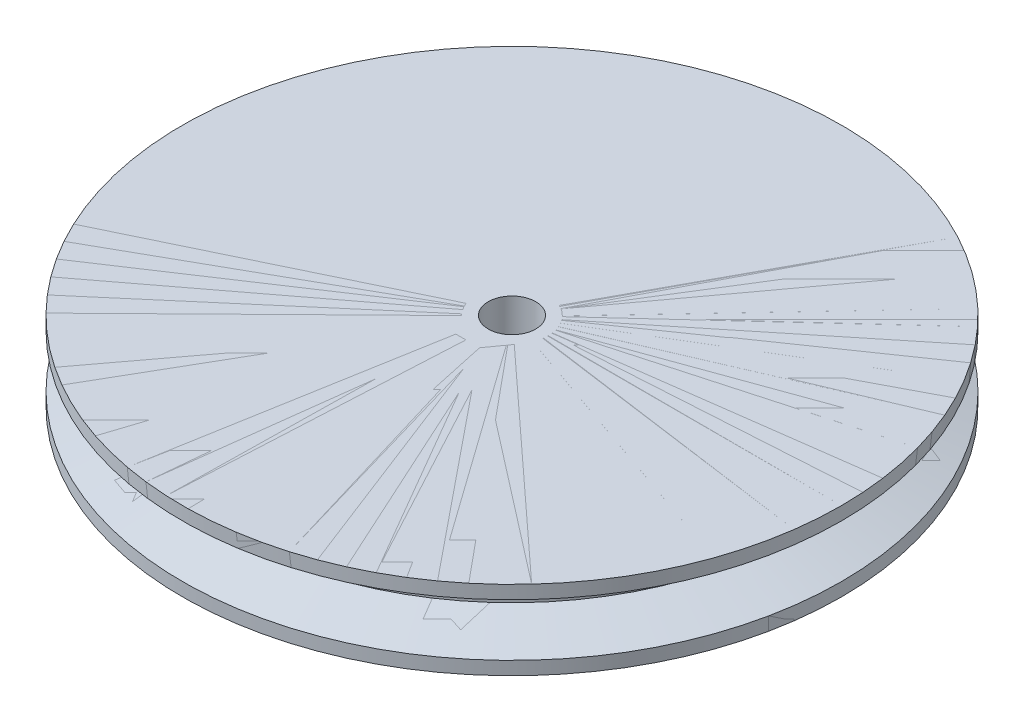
ISO-10303-21;
HEADER;
FILE_DESCRIPTION(('STEP AP214'),'2;1');
FILE_NAME('part.step','',(''),(''),'','','');
FILE_SCHEMA(('AUTOMOTIVE_DESIGN { 1 0 10303 214 1 1 1 1 }'));
ENDSEC;
DATA;
#1=APPLICATION_CONTEXT('core data for automotive mechanical design processes');
#2=APPLICATION_PROTOCOL_DEFINITION('international standard','automotive_design',2000,#1);
#3=PRODUCT_CONTEXT('',#1,'mechanical');
#4=PRODUCT('Part','Part','',(#3));
#5=PRODUCT_RELATED_PRODUCT_CATEGORY('part','',(#4));
#6=PRODUCT_DEFINITION_FORMATION('','',#4);
#7=PRODUCT_DEFINITION_CONTEXT('part definition',#1,'design');
#8=PRODUCT_DEFINITION('design','',#6,#7);
#9=PRODUCT_DEFINITION_SHAPE('','',#8);
#10=(LENGTH_UNIT() NAMED_UNIT(*) SI_UNIT(.MILLI.,.METRE.));
#11=(NAMED_UNIT(*) PLANE_ANGLE_UNIT() SI_UNIT($,.RADIAN.));
#12=(NAMED_UNIT(*) SI_UNIT($,.STERADIAN.) SOLID_ANGLE_UNIT());
#13=UNCERTAINTY_MEASURE_WITH_UNIT(LENGTH_MEASURE(1.E-05),#10,'distance_accuracy_value','');
#14=(GEOMETRIC_REPRESENTATION_CONTEXT(3) GLOBAL_UNCERTAINTY_ASSIGNED_CONTEXT((#13)) GLOBAL_UNIT_ASSIGNED_CONTEXT((#10,
#11,#12)) REPRESENTATION_CONTEXT('',''));
#15=CARTESIAN_POINT('',(0.,0.,0.));
#16=DIRECTION('',(0.,0.,1.));
#17=DIRECTION('',(1.,0.,0.));
#18=AXIS2_PLACEMENT_3D('',#15,#16,#17);
#19=CARTESIAN_POINT('',(-3.,0.,11.2));
#20=DIRECTION('',(0.,0.,1.));
#21=DIRECTION('',(0.,-1.,0.));
#22=AXIS2_PLACEMENT_3D('',#19,#20,#21);
#23=PLANE('',#22);
#24=DIRECTION('',(0.,-1.,0.));
#25=VECTOR('',#24,1.);
#26=CARTESIAN_POINT('',(3.,0.,11.2));
#27=LINE('',#26,#25);
#28=CARTESIAN_POINT('',(3.,0.,11.2));
#29=VERTEX_POINT('',#28);
#30=CARTESIAN_POINT('',(2.99999999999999,-33.,11.2));
#31=VERTEX_POINT('',#30);
#32=EDGE_CURVE('P0_E85',#29,#31,#27,.T.);
#33=ORIENTED_EDGE('',*,*,#32,.T.);
#34=CARTESIAN_POINT('',(0.,-33.,11.2));
#35=DIRECTION('',(0.,0.,-1.));
#36=DIRECTION('',(0.,1.,0.));
#37=AXIS2_PLACEMENT_3D('',#34,#35,#36);
#38=CIRCLE('',#37,3.);
#39=CARTESIAN_POINT('',(-3.,-33.,11.2));
#40=VERTEX_POINT('',#39);
#41=EDGE_CURVE('P0_E44',#40,#31,#38,.T.);
#42=ORIENTED_EDGE('',*,*,#41,.F.);
#43=DIRECTION('',(0.,-1.,0.));
#44=VECTOR('',#43,1.);
#45=CARTESIAN_POINT('',(-3.,0.,11.2));
#46=LINE('',#45,#44);
#47=CARTESIAN_POINT('',(-3.,0.,11.2));
#48=VERTEX_POINT('',#47);
#49=EDGE_CURVE('P0_E83',#48,#40,#46,.T.);
#50=ORIENTED_EDGE('',*,*,#49,.F.);
#51=DIRECTION('',(-1.,0.,0.));
#52=VECTOR('',#51,1.);
#53=CARTESIAN_POINT('',(-3.,0.,11.2));
#54=LINE('',#53,#52);
#55=EDGE_CURVE('P0_E52',#29,#48,#54,.T.);
#56=ORIENTED_EDGE('',*,*,#55,.F.);
#57=EDGE_LOOP('',(#33,#42,#50,#56));
#58=FACE_BOUND('',#57,.T.);
#59=ADVANCED_FACE('P0_F28',(#58),#23,.F.);
#60=CARTESIAN_POINT('',(0.,0.,0.));
#61=DIRECTION('',(0.,-1.,0.));
#62=DIRECTION('',(1.,0.,0.));
#63=AXIS2_PLACEMENT_3D('',#60,#61,#62);
#64=CYLINDRICAL_SURFACE('',#63,83.3);
#65=CARTESIAN_POINT('',(0.,-3.3637188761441,0.));
#66=DIRECTION('',(0.,1.,0.));
#67=DIRECTION('',(0.,0.,-1.));
#68=AXIS2_PLACEMENT_3D('',#65,#66,#67);
#69=CIRCLE('',#68,83.3);
#70=CARTESIAN_POINT('',(0.,-3.3637188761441,-83.3));
#71=VERTEX_POINT('',#70);
#72=EDGE_CURVE('P0_E117',#71,#71,#69,.T.);
#73=ORIENTED_EDGE('',*,*,#72,.T.);
#74=EDGE_LOOP('',(#73));
#75=FACE_BOUND('',#74,.T.);
#76=CARTESIAN_POINT('',(0.,0.,0.));
#77=DIRECTION('',(0.,-1.,0.));
#78=DIRECTION('',(1.,0.,0.));
#79=AXIS2_PLACEMENT_3D('',#76,#77,#78);
#80=CIRCLE('',#79,83.3);
#81=CARTESIAN_POINT('',(83.3,0.,0.));
#82=VERTEX_POINT('',#81);
#83=EDGE_CURVE('P0_E32',#82,#82,#80,.F.);
#84=ORIENTED_EDGE('',*,*,#83,.F.);
#85=EDGE_LOOP('',(#84));
#86=FACE_BOUND('',#85,.T.);
#87=ADVANCED_FACE('P0_F146',(#75,#86),#64,.T.);
#88=CARTESIAN_POINT('',(0.,0.,-41.65));
#89=DIRECTION('',(0.,1.,0.));
#90=DIRECTION('',(0.,0.,1.));
#91=AXIS2_PLACEMENT_3D('',#88,#89,#90);
#92=PLANE('',#91);
#93=CARTESIAN_POINT('',(0.,0.,0.));
#94=DIRECTION('',(0.,-1.,0.));
#95=DIRECTION('',(1.,0.,0.));
#96=AXIS2_PLACEMENT_3D('',#93,#94,#95);
#97=CIRCLE('',#96,9.);
#98=CARTESIAN_POINT('',(-3.,0.,8.48528137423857));
#99=VERTEX_POINT('',#98);
#100=CARTESIAN_POINT('',(3.,0.,8.48528137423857));
#101=VERTEX_POINT('',#100);
#102=EDGE_CURVE('P0_E291',#99,#101,#97,.T.);
#103=ORIENTED_EDGE('',*,*,#102,.T.);
#104=DIRECTION('',(0.,0.,1.));
#105=VECTOR('',#104,1.);
#106=CARTESIAN_POINT('',(3.,0.,11.2));
#107=LINE('',#106,#105);
#108=EDGE_CURVE('P0_E293',#101,#29,#107,.T.);
#109=ORIENTED_EDGE('',*,*,#108,.T.);
#110=ORIENTED_EDGE('',*,*,#55,.T.);
#111=DIRECTION('',(0.,0.,-1.));
#112=VECTOR('',#111,1.);
#113=CARTESIAN_POINT('',(-3.,0.,8.48528137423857));
#114=LINE('',#113,#112);
#115=EDGE_CURVE('P0_E97',#48,#99,#114,.T.);
#116=ORIENTED_EDGE('',*,*,#115,.T.);
#117=EDGE_LOOP('',(#103,#109,#110,#116));
#118=FACE_BOUND('',#117,.T.);
#119=ORIENTED_EDGE('',*,*,#83,.T.);
#120=EDGE_LOOP('',(#119));
#121=FACE_BOUND('',#120,.T.);
#122=ADVANCED_FACE('P0_F152',(#118,#121),#92,.T.);
#123=CARTESIAN_POINT('',(0.,-7.49565023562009,0.));
#124=DIRECTION('',(0.,1.,0.));
#125=DIRECTION('',(-1.,0.,0.));
#126=AXIS2_PLACEMENT_3D('',#123,#124,#125);
#127=CONICAL_SURFACE('',#126,71.3,1.23918376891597);
#128=CARTESIAN_POINT('',(0.,-7.49565023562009,0.));
#129=DIRECTION('',(0.,1.,0.));
#130=DIRECTION('',(0.,0.,-1.));
#131=AXIS2_PLACEMENT_3D('',#128,#129,#130);
#132=CIRCLE('',#131,71.3);
#133=CARTESIAN_POINT('',(0.,-7.49565023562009,-71.3));
#134=VERTEX_POINT('',#133);
#135=EDGE_CURVE('P0_E114',#134,#134,#132,.T.);
#136=ORIENTED_EDGE('',*,*,#135,.T.);
#137=EDGE_LOOP('',(#136));
#138=FACE_BOUND('',#137,.T.);
#139=ORIENTED_EDGE('',*,*,#72,.F.);
#140=EDGE_LOOP('',(#139));
#141=FACE_BOUND('',#140,.T.);
#142=ADVANCED_FACE('P0_F141',(#138,#141),#127,.T.);
#143=CARTESIAN_POINT('',(0.,-7.49565023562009,0.));
#144=DIRECTION('',(0.,-1.,0.));
#145=DIRECTION('',(1.,0.,0.));
#146=AXIS2_PLACEMENT_3D('',#143,#144,#145);
#147=CYLINDRICAL_SURFACE('',#146,71.3);
#148=CARTESIAN_POINT('',(0.,-12.5043497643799,0.));
#149=DIRECTION('',(0.,-1.,0.));
#150=DIRECTION('',(0.,0.,-1.));
#151=AXIS2_PLACEMENT_3D('',#148,#149,#150);
#152=CIRCLE('',#151,71.3);
#153=CARTESIAN_POINT('',(0.,-12.5043497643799,-71.3));
#154=VERTEX_POINT('',#153);
#155=EDGE_CURVE('P0_E111',#154,#154,#152,.F.);
#156=ORIENTED_EDGE('',*,*,#155,.T.);
#157=EDGE_LOOP('',(#156));
#158=FACE_BOUND('',#157,.T.);
#159=ORIENTED_EDGE('',*,*,#135,.F.);
#160=EDGE_LOOP('',(#159));
#161=FACE_BOUND('',#160,.T.);
#162=ADVANCED_FACE('P0_F130',(#158,#161),#147,.T.);
#163=CARTESIAN_POINT('',(0.,-40.,-15.));
#164=DIRECTION('',(0.,-1.,0.));
#165=DIRECTION('',(1.,0.,0.));
#166=AXIS2_PLACEMENT_3D('',#163,#164,#165);
#167=PLANE('',#166);
#168=CARTESIAN_POINT('',(0.,-40.,0.));
#169=DIRECTION('',(0.,-1.,0.));
#170=DIRECTION('',(1.,0.,0.));
#171=AXIS2_PLACEMENT_3D('',#168,#169,#170);
#172=CIRCLE('',#171,9.);
#173=CARTESIAN_POINT('',(-3.00000000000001,-40.,8.48528137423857));
#174=VERTEX_POINT('',#173);
#175=CARTESIAN_POINT('',(2.99999999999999,-40.,8.48528137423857));
#176=VERTEX_POINT('',#175);
#177=EDGE_CURVE('P0_E187',#174,#176,#172,.T.);
#178=ORIENTED_EDGE('',*,*,#177,.F.);
#179=DIRECTION('',(0.,0.,-1.));
#180=VECTOR('',#179,1.);
#181=CARTESIAN_POINT('',(-3.00000000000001,-40.,8.48528137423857));
#182=LINE('',#181,#180);
#183=CARTESIAN_POINT('',(-3.00000000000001,-40.,11.2));
#184=VERTEX_POINT('',#183);
#185=EDGE_CURVE('P0_E294',#184,#174,#182,.T.);
#186=ORIENTED_EDGE('',*,*,#185,.F.);
#187=DIRECTION('',(-1.,0.,0.));
#188=VECTOR('',#187,1.);
#189=CARTESIAN_POINT('',(-3.00000000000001,-40.,11.2));
#190=LINE('',#189,#188);
#191=CARTESIAN_POINT('',(2.99999999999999,-40.,11.2));
#192=VERTEX_POINT('',#191);
#193=EDGE_CURVE('P0_E90',#192,#184,#190,.T.);
#194=ORIENTED_EDGE('',*,*,#193,.F.);
#195=DIRECTION('',(0.,0.,1.));
#196=VECTOR('',#195,1.);
#197=CARTESIAN_POINT('',(2.99999999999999,-40.,11.2));
#198=LINE('',#197,#196);
#199=EDGE_CURVE('P0_E300',#176,#192,#198,.T.);
#200=ORIENTED_EDGE('',*,*,#199,.F.);
#201=EDGE_LOOP('',(#178,#186,#194,#200));
#202=FACE_BOUND('',#201,.T.);
#203=CARTESIAN_POINT('',(0.,-40.,0.));
#204=DIRECTION('',(0.,-1.,0.));
#205=DIRECTION('',(1.,0.,0.));
#206=AXIS2_PLACEMENT_3D('',#203,#204,#205);
#207=CIRCLE('',#206,30.);
#208=CARTESIAN_POINT('',(30.,-40.,0.));
#209=VERTEX_POINT('',#208);
#210=EDGE_CURVE('P0_E110',#209,#209,#207,.F.);
#211=ORIENTED_EDGE('',*,*,#210,.F.);
#212=EDGE_LOOP('',(#211));
#213=FACE_BOUND('',#212,.T.);
#214=ADVANCED_FACE('P0_F127',(#202,#213),#167,.T.);
#215=CARTESIAN_POINT('',(0.,-12.5043497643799,0.));
#216=DIRECTION('',(0.,-1.,0.));
#217=DIRECTION('',(1.,0.,0.));
#218=AXIS2_PLACEMENT_3D('',#215,#216,#217);
#219=CONICAL_SURFACE('',#218,71.3,1.23918376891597);
#220=CARTESIAN_POINT('',(0.,-16.6362811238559,0.));
#221=DIRECTION('',(0.,-1.,0.));
#222=DIRECTION('',(0.,0.,-1.));
#223=AXIS2_PLACEMENT_3D('',#220,#221,#222);
#224=CIRCLE('',#223,83.3);
#225=CARTESIAN_POINT('',(5.53140666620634E-12,-16.6362811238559,-83.3));
#226=VERTEX_POINT('',#225);
#227=EDGE_CURVE('P0_E107',#226,#226,#224,.T.);
#228=ORIENTED_EDGE('',*,*,#227,.F.);
#229=EDGE_LOOP('',(#228));
#230=FACE_BOUND('',#229,.T.);
#231=ORIENTED_EDGE('',*,*,#155,.F.);
#232=EDGE_LOOP('',(#231));
#233=FACE_BOUND('',#232,.T.);
#234=ADVANCED_FACE('P0_F129',(#230,#233),#219,.T.);
#235=CARTESIAN_POINT('',(0.,-20.,0.));
#236=DIRECTION('',(0.,-1.,0.));
#237=DIRECTION('',(1.,0.,0.));
#238=AXIS2_PLACEMENT_3D('',#235,#236,#237);
#239=CYLINDRICAL_SURFACE('',#238,30.);
#240=CARTESIAN_POINT('',(0.,-30.,30.));
#241=CARTESIAN_POINT('',(-0.168061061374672,-30.0000072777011,29.9999980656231));
#242=CARTESIAN_POINT('',(-0.336233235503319,-30.0141698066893,29.9985727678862));
#243=CARTESIAN_POINT('',(-0.667915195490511,-30.0704531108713,29.9930240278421));
#244=CARTESIAN_POINT('',(-0.831419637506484,-30.1126046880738,29.9888976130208));
#245=CARTESIAN_POINT('',(-1.14891502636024,-30.2236267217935,29.9784124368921));
#246=CARTESIAN_POINT('',(-1.30291165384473,-30.2924810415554,29.9720550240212));
#247=CARTESIAN_POINT('',(-1.59712848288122,-30.4549227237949,29.9578187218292));
#248=CARTESIAN_POINT('',(-1.73735141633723,-30.5485051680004,29.9499401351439));
#249=CARTESIAN_POINT('',(-2.00057865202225,-30.7581080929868,29.9335123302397));
#250=CARTESIAN_POINT('',(-2.12352643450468,-30.8741993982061,29.924961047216));
#251=CARTESIAN_POINT('',(-2.34822756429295,-31.1253736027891,29.9081687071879));
#252=CARTESIAN_POINT('',(-2.44997993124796,-31.2604573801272,29.8999276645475));
#253=CARTESIAN_POINT('',(-2.62960191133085,-31.5461355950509,29.8846677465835));
#254=CARTESIAN_POINT('',(-2.70742039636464,-31.6967623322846,29.8776515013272));
#255=CARTESIAN_POINT('',(-2.83663915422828,-32.0090267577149,29.8656611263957));
#256=CARTESIAN_POINT('',(-2.88804007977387,-32.1706641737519,29.8606869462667));
#257=CARTESIAN_POINT('',(-2.96279712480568,-32.499785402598,29.8533625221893));
#258=CARTESIAN_POINT('',(-2.98624695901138,-32.6672477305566,29.8510035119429));
#259=CARTESIAN_POINT('',(-3.00472585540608,-33.0037465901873,29.8491492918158));
#260=CARTESIAN_POINT('',(-2.99975566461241,-33.1727830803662,29.8496540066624));
#261=CARTESIAN_POINT('',(-2.96161284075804,-33.50698592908,29.853462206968));
#262=CARTESIAN_POINT('',(-2.92854253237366,-33.6721640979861,29.8567555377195));
#263=CARTESIAN_POINT('',(-2.83529743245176,-33.9946138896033,29.8657540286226));
#264=CARTESIAN_POINT('',(-2.77512227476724,-34.1518854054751,29.8714592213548));
#265=CARTESIAN_POINT('',(-2.62926268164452,-34.4543807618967,29.8846502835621));
#266=CARTESIAN_POINT('',(-2.54353284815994,-34.599582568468,29.8921393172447));
#267=CARTESIAN_POINT('',(-2.34903008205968,-34.8735756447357,29.9080515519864));
#268=CARTESIAN_POINT('',(-2.24025647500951,-35.0023664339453,29.9164747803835));
#269=CARTESIAN_POINT('',(-2.0021823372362,-35.2404761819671,29.9333515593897));
#270=CARTESIAN_POINT('',(-1.87279343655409,-35.3497068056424,29.9418050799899));
#271=CARTESIAN_POINT('',(-1.59746844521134,-35.5449108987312,29.9577548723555));
#272=CARTESIAN_POINT('',(-1.4515323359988,-35.6308843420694,29.9652511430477));
#273=CARTESIAN_POINT('',(-1.14719431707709,-35.7771300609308,29.9784442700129));
#274=CARTESIAN_POINT('',(-0.988790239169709,-35.8373978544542,29.9841408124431));
#275=CARTESIAN_POINT('',(-0.664041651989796,-35.9304567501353,29.9930894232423));
#276=CARTESIAN_POINT('',(-0.497697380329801,-35.9632486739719,29.9963415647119));
#277=CARTESIAN_POINT('',(-0.162555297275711,-36.0003129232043,30.0000255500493));
#278=CARTESIAN_POINT('',(0.00622890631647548,-36.0047071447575,30.0004694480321));
#279=CARTESIAN_POINT('',(0.342131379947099,-35.9851714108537,29.9985192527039));
#280=CARTESIAN_POINT('',(0.50924967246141,-35.9612418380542,29.996125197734));
#281=CARTESIAN_POINT('',(0.836724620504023,-35.8858389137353,29.9887758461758));
#282=CARTESIAN_POINT('',(0.997094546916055,-35.834422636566,29.9838258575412));
#283=CARTESIAN_POINT('',(1.30693296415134,-35.7055644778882,29.9719199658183));
#284=CARTESIAN_POINT('',(1.45640121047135,-35.6281220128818,29.9649640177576));
#285=CARTESIAN_POINT('',(1.74074454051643,-35.4491074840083,29.9497942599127));
#286=CARTESIAN_POINT('',(1.87556897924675,-35.3474553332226,29.9415763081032));
#287=CARTESIAN_POINT('',(2.12628486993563,-35.1230217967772,29.9248179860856));
#288=CARTESIAN_POINT('',(2.24217584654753,-35.0002398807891,29.9162776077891));
#289=CARTESIAN_POINT('',(2.45215832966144,-34.736500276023,29.8998007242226));
#290=CARTESIAN_POINT('',(2.54616983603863,-34.5954787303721,29.8918665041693));
#291=CARTESIAN_POINT('',(2.70917477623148,-34.29957791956,29.8775349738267));
#292=CARTESIAN_POINT('',(2.77816855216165,-34.1446988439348,29.8711376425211));
#293=CARTESIAN_POINT('',(2.88904562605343,-33.8257537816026,29.8606184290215));
#294=CARTESIAN_POINT('',(2.93097652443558,-33.6617044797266,29.8564925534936));
#295=CARTESIAN_POINT('',(2.98669202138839,-33.3288504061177,29.8509709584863));
#296=CARTESIAN_POINT('',(3.00047742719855,-33.160045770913,29.8495751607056));
#297=CARTESIAN_POINT('',(2.99949941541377,-32.8232679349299,29.8496733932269));
#298=CARTESIAN_POINT('',(2.98486166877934,-32.6552943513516,29.8511547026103));
#299=CARTESIAN_POINT('',(2.92771635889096,-32.3242052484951,29.8568131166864));
#300=CARTESIAN_POINT('',(2.88520876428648,-32.1610897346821,29.8609902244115));
#301=CARTESIAN_POINT('',(2.77356505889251,-31.8443479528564,29.8715660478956));
#302=CARTESIAN_POINT('',(2.70443263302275,-31.6907203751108,29.8779644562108));
#303=CARTESIAN_POINT('',(2.54151466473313,-31.3972293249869,29.8922625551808));
#304=CARTESIAN_POINT('',(2.44772926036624,-31.2573657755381,29.9001622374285));
#305=CARTESIAN_POINT('',(2.23769566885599,-30.9947289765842,29.9166146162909));
#306=CARTESIAN_POINT('',(2.1213538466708,-30.8720307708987,29.9251699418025));
#307=CARTESIAN_POINT('',(1.86969509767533,-30.647843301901,29.9419456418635));
#308=CARTESIAN_POINT('',(1.73437363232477,-30.5463591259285,29.9501659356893));
#309=CARTESIAN_POINT('',(1.44822430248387,-30.3672796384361,29.9653668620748));
#310=CARTESIAN_POINT('',(1.29735824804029,-30.2897451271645,29.9723443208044));
#311=CARTESIAN_POINT('',(0.98477483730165,-30.1612127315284,29.9842388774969));
#312=CARTESIAN_POINT('',(0.823069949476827,-30.1101849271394,29.9891582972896));
#313=CARTESIAN_POINT('',(0.550374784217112,-30.0488381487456,29.995146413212));
#314=CARTESIAN_POINT('',(0.441127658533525,-30.0305488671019,29.996958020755));
#315=CARTESIAN_POINT('',(0.221269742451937,-30.0061274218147,29.9993854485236));
#316=CARTESIAN_POINT('',(0.110658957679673,-29.9999952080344,30.0000012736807));
#317=CARTESIAN_POINT('',(0.,-30.,30.));
#318=B_SPLINE_CURVE_WITH_KNOTS('',3,(#240,#241,#242,#243,#244,#245,#246,#247,#248,#249,#250,
#251,#252,#253,#254,#255,#256,#257,#258,#259,#260,#261,#262,#263,#264,#265,#266,#267,#268,#269,
#270,#271,#272,#273,#274,#275,#276,#277,#278,#279,#280,#281,#282,#283,#284,#285,#286,#287,#288,
#289,#290,#291,#292,#293,#294,#295,#296,#297,#298,#299,#300,#301,#302,#303,#304,#305,#306,#307,
#308,#309,#310,#311,#312,#313,#314,#315,#316,#317),.UNSPECIFIED.,.T.,.F.,(4,2,2,2,2,2,2,2,2,2,2,
2,2,2,2,2,2,2,2,2,2,2,2,2,2,2,2,2,2,2,2,2,2,2,2,2,2,2,4),(0.,0.503779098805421,1.00811352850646,
1.5121436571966,2.01607361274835,2.52161570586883,3.02718117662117,3.53381926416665,
4.04044483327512,4.54536696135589,5.05027581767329,5.5533539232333,6.05643882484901,
6.56042284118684,7.06442160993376,7.5706420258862,8.07686300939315,8.58317222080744,
9.08946629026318,9.59358565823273,10.0976982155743,10.6007680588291,11.103849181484,
11.6086182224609,12.1133999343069,12.6199993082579,13.1265917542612,13.6322907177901,
14.1379751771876,14.6414288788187,15.1448831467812,15.648267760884,16.1516495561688,
16.6571675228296,17.1628065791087,17.6697189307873,18.1760578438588,18.5077700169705,
18.8394808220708),.UNSPECIFIED.);
#319=CARTESIAN_POINT('',(0.,-30.,30.));
#320=VERTEX_POINT('',#319);
#321=EDGE_CURVE('P0_E80',#320,#320,#318,.T.);
#322=ORIENTED_EDGE('',*,*,#321,.F.);
#323=EDGE_LOOP('',(#322));
#324=FACE_BOUND('',#323,.T.);
#325=ORIENTED_EDGE('',*,*,#210,.T.);
#326=EDGE_LOOP('',(#325));
#327=FACE_BOUND('',#326,.T.);
#328=CARTESIAN_POINT('',(0.,-20.,0.));
#329=DIRECTION('',(0.,-1.,0.));
#330=DIRECTION('',(1.,0.,0.));
#331=AXIS2_PLACEMENT_3D('',#328,#329,#330);
#332=CIRCLE('',#331,30.);
#333=CARTESIAN_POINT('',(30.,-20.,0.));
#334=VERTEX_POINT('',#333);
#335=EDGE_CURVE('P0_E37',#334,#334,#332,.F.);
#336=ORIENTED_EDGE('',*,*,#335,.F.);
#337=EDGE_LOOP('',(#336));
#338=FACE_BOUND('',#337,.T.);
#339=ADVANCED_FACE('P0_F124',(#324,#327,#338),#239,.T.);
#340=CARTESIAN_POINT('',(0.,-16.6362811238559,0.));
#341=DIRECTION('',(0.,-1.,0.));
#342=DIRECTION('',(1.,0.,0.));
#343=AXIS2_PLACEMENT_3D('',#340,#341,#342);
#344=CYLINDRICAL_SURFACE('',#343,83.3);
#345=CARTESIAN_POINT('',(0.,-20.,0.));
#346=DIRECTION('',(0.,-1.,0.));
#347=DIRECTION('',(1.,0.,0.));
#348=AXIS2_PLACEMENT_3D('',#345,#346,#347);
#349=CIRCLE('',#348,83.3);
#350=CARTESIAN_POINT('',(83.3,-20.,0.));
#351=VERTEX_POINT('',#350);
#352=EDGE_CURVE('P0_E11',#351,#351,#349,.T.);
#353=ORIENTED_EDGE('',*,*,#352,.F.);
#354=EDGE_LOOP('',(#353));
#355=FACE_BOUND('',#354,.T.);
#356=ORIENTED_EDGE('',*,*,#227,.T.);
#357=EDGE_LOOP('',(#356));
#358=FACE_BOUND('',#357,.T.);
#359=ADVANCED_FACE('P0_F161',(#355,#358),#344,.T.);
#360=CARTESIAN_POINT('',(0.,-20.,-56.65));
#361=DIRECTION('',(0.,-1.,0.));
#362=DIRECTION('',(1.,0.,0.));
#363=AXIS2_PLACEMENT_3D('',#360,#361,#362);
#364=PLANE('',#363);
#365=ORIENTED_EDGE('',*,*,#352,.T.);
#366=EDGE_LOOP('',(#365));
#367=FACE_BOUND('',#366,.T.);
#368=ORIENTED_EDGE('',*,*,#335,.T.);
#369=EDGE_LOOP('',(#368));
#370=FACE_BOUND('',#369,.T.);
#371=ADVANCED_FACE('P0_F30',(#367,#370),#364,.T.);
#372=CARTESIAN_POINT('',(0.,0.,0.));
#373=DIRECTION('',(0.,-1.,0.));
#374=DIRECTION('',(1.,0.,0.));
#375=AXIS2_PLACEMENT_3D('',#372,#373,#374);
#376=CYLINDRICAL_SURFACE('',#375,9.);
#377=ORIENTED_EDGE('',*,*,#177,.T.);
#378=DIRECTION('',(0.,-1.,0.));
#379=VECTOR('',#378,1.);
#380=CARTESIAN_POINT('',(3.,0.,8.48528137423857));
#381=LINE('',#380,#379);
#382=EDGE_CURVE('P0_E104',#101,#176,#381,.T.);
#383=ORIENTED_EDGE('',*,*,#382,.F.);
#384=ORIENTED_EDGE('',*,*,#102,.F.);
#385=DIRECTION('',(0.,-1.,0.));
#386=VECTOR('',#385,1.);
#387=CARTESIAN_POINT('',(-3.,0.,8.48528137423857));
#388=LINE('',#387,#386);
#389=EDGE_CURVE('P0_E98',#99,#174,#388,.T.);
#390=ORIENTED_EDGE('',*,*,#389,.T.);
#391=EDGE_LOOP('',(#377,#383,#384,#390));
#392=FACE_BOUND('',#391,.T.);
#393=ADVANCED_FACE('P0_F155',(#392),#376,.F.);
#394=CARTESIAN_POINT('',(-3.,0.,8.48528137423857));
#395=DIRECTION('',(-1.,0.,0.));
#396=DIRECTION('',(0.,-1.,0.));
#397=AXIS2_PLACEMENT_3D('',#394,#395,#396);
#398=PLANE('',#397);
#399=ORIENTED_EDGE('',*,*,#185,.T.);
#400=ORIENTED_EDGE('',*,*,#389,.F.);
#401=ORIENTED_EDGE('',*,*,#115,.F.);
#402=ORIENTED_EDGE('',*,*,#49,.T.);
#403=EDGE_CURVE('P0_E87',#40,#184,#46,.T.);
#404=ORIENTED_EDGE('',*,*,#403,.T.);
#405=EDGE_LOOP('',(#399,#400,#401,#402,#404));
#406=FACE_BOUND('',#405,.T.);
#407=ADVANCED_FACE('P0_F95',(#406),#398,.F.);
#408=ORIENTED_EDGE('',*,*,#403,.F.);
#409=EDGE_CURVE('P0_E75',#31,#40,#38,.T.);
#410=ORIENTED_EDGE('',*,*,#409,.F.);
#411=EDGE_CURVE('P0_E103',#31,#192,#27,.T.);
#412=ORIENTED_EDGE('',*,*,#411,.T.);
#413=ORIENTED_EDGE('',*,*,#193,.T.);
#414=EDGE_LOOP('',(#408,#410,#412,#413));
#415=FACE_BOUND('',#414,.T.);
#416=ADVANCED_FACE('P0_F88',(#415),#23,.F.);
#417=CARTESIAN_POINT('',(3.,0.,11.2));
#418=DIRECTION('',(1.,0.,0.));
#419=DIRECTION('',(0.,1.,0.));
#420=AXIS2_PLACEMENT_3D('',#417,#418,#419);
#421=PLANE('',#420);
#422=ORIENTED_EDGE('',*,*,#199,.T.);
#423=ORIENTED_EDGE('',*,*,#411,.F.);
#424=ORIENTED_EDGE('',*,*,#32,.F.);
#425=ORIENTED_EDGE('',*,*,#108,.F.);
#426=ORIENTED_EDGE('',*,*,#382,.T.);
#427=EDGE_LOOP('',(#422,#423,#424,#425,#426));
#428=FACE_BOUND('',#427,.T.);
#429=ADVANCED_FACE('P0_F159',(#428),#421,.F.);
#430=CARTESIAN_POINT('',(0.,-33.,83.3));
#431=DIRECTION('',(0.,0.,-1.));
#432=DIRECTION('',(0.,1.,0.));
#433=AXIS2_PLACEMENT_3D('',#430,#431,#432);
#434=CYLINDRICAL_SURFACE('',#433,3.);
#435=ORIENTED_EDGE('',*,*,#321,.T.);
#436=EDGE_LOOP('',(#435));
#437=FACE_BOUND('',#436,.T.);
#438=ORIENTED_EDGE('',*,*,#409,.T.);
#439=ORIENTED_EDGE('',*,*,#41,.T.);
#440=EDGE_LOOP('',(#438,#439));
#441=FACE_BOUND('',#440,.T.);
#442=ADVANCED_FACE('P0_F76',(#437,#441),#434,.F.);
#443=CLOSED_SHELL('',(#59,#87,#122,#142,#162,#214,#234,#339,#359,#371,#393,#407,#416,#429,#442));
#444=MANIFOLD_SOLID_BREP('P0_B2',#443);
#445=CARTESIAN_POINT('',(0.,0.,0.));
#446=DIRECTION('',(0.,-1.,0.));
#447=DIRECTION('',(1.,0.,0.));
#448=AXIS2_PLACEMENT_3D('',#445,#446,#447);
#449=CYLINDRICAL_SURFACE('',#448,83.3);
#450=CARTESIAN_POINT('',(0.,-3.3637188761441,0.));
#451=DIRECTION('',(0.,1.,0.));
#452=DIRECTION('',(0.,0.,-1.));
#453=AXIS2_PLACEMENT_3D('',#450,#451,#452);
#454=CIRCLE('',#453,83.3);
#455=CARTESIAN_POINT('',(0.,-3.3637188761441,-83.3));
#456=VERTEX_POINT('',#455);
#457=EDGE_CURVE('P1_E30',#456,#456,#454,.T.);
#458=ORIENTED_EDGE('',*,*,#457,.T.);
#459=EDGE_LOOP('',(#458));
#460=FACE_BOUND('',#459,.T.);
#461=CARTESIAN_POINT('',(0.,0.,0.));
#462=DIRECTION('',(0.,-1.,0.));
#463=DIRECTION('',(1.,0.,0.));
#464=AXIS2_PLACEMENT_3D('',#461,#462,#463);
#465=CIRCLE('',#464,83.3);
#466=CARTESIAN_POINT('',(83.3,0.,0.));
#467=VERTEX_POINT('',#466);
#468=EDGE_CURVE('P1_E18',#467,#467,#465,.F.);
#469=ORIENTED_EDGE('',*,*,#468,.F.);
#470=EDGE_LOOP('',(#469));
#471=FACE_BOUND('',#470,.T.);
#472=ADVANCED_FACE('P1_F14',(#460,#471),#449,.T.);
#473=CARTESIAN_POINT('',(0.,0.,-41.65));
#474=DIRECTION('',(0.,1.,0.));
#475=DIRECTION('',(0.,0.,1.));
#476=AXIS2_PLACEMENT_3D('',#473,#474,#475);
#477=PLANE('',#476);
#478=ORIENTED_EDGE('',*,*,#468,.T.);
#479=EDGE_LOOP('',(#478));
#480=FACE_BOUND('',#479,.T.);
#481=CARTESIAN_POINT('',(0.,0.,0.));
#482=DIRECTION('',(0.,-1.,0.));
#483=DIRECTION('',(1.,0.,0.));
#484=AXIS2_PLACEMENT_3D('',#481,#482,#483);
#485=CIRCLE('',#484,6.);
#486=CARTESIAN_POINT('',(6.,0.,0.));
#487=VERTEX_POINT('',#486);
#488=EDGE_CURVE('P1_E40',#487,#487,#485,.T.);
#489=ORIENTED_EDGE('',*,*,#488,.T.);
#490=EDGE_LOOP('',(#489));
#491=FACE_BOUND('',#490,.T.);
#492=ADVANCED_FACE('P1_F51',(#480,#491),#477,.T.);
#493=CARTESIAN_POINT('',(0.,-7.49565023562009,0.));
#494=DIRECTION('',(0.,1.,0.));
#495=DIRECTION('',(-1.,0.,0.));
#496=AXIS2_PLACEMENT_3D('',#493,#494,#495);
#497=CONICAL_SURFACE('',#496,71.3,1.23918376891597);
#498=CARTESIAN_POINT('',(0.,-7.49565023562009,0.));
#499=DIRECTION('',(0.,1.,0.));
#500=DIRECTION('',(0.,0.,-1.));
#501=AXIS2_PLACEMENT_3D('',#498,#499,#500);
#502=CIRCLE('',#501,71.3);
#503=CARTESIAN_POINT('',(0.,-7.49565023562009,-71.3));
#504=VERTEX_POINT('',#503);
#505=EDGE_CURVE('P1_E39',#504,#504,#502,.T.);
#506=ORIENTED_EDGE('',*,*,#505,.T.);
#507=EDGE_LOOP('',(#506));
#508=FACE_BOUND('',#507,.T.);
#509=ORIENTED_EDGE('',*,*,#457,.F.);
#510=EDGE_LOOP('',(#509));
#511=FACE_BOUND('',#510,.T.);
#512=ADVANCED_FACE('P1_F60',(#508,#511),#497,.T.);
#513=CARTESIAN_POINT('',(0.,0.,0.));
#514=DIRECTION('',(0.,-1.,0.));
#515=DIRECTION('',(1.,0.,0.));
#516=AXIS2_PLACEMENT_3D('',#513,#514,#515);
#517=CYLINDRICAL_SURFACE('',#516,6.);
#518=CARTESIAN_POINT('',(0.,-40.,0.));
#519=DIRECTION('',(0.,-1.,0.));
#520=DIRECTION('',(1.,0.,0.));
#521=AXIS2_PLACEMENT_3D('',#518,#519,#520);
#522=CIRCLE('',#521,6.);
#523=CARTESIAN_POINT('',(5.99999999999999,-40.,0.));
#524=VERTEX_POINT('',#523);
#525=EDGE_CURVE('P1_E37',#524,#524,#522,.F.);
#526=ORIENTED_EDGE('',*,*,#525,.F.);
#527=EDGE_LOOP('',(#526));
#528=FACE_BOUND('',#527,.T.);
#529=ORIENTED_EDGE('',*,*,#488,.F.);
#530=EDGE_LOOP('',(#529));
#531=FACE_BOUND('',#530,.T.);
#532=ADVANCED_FACE('P1_F91',(#528,#531),#517,.F.);
#533=CARTESIAN_POINT('',(0.,-7.49565023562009,0.));
#534=DIRECTION('',(0.,-1.,0.));
#535=DIRECTION('',(1.,0.,0.));
#536=AXIS2_PLACEMENT_3D('',#533,#534,#535);
#537=CYLINDRICAL_SURFACE('',#536,71.3);
#538=CARTESIAN_POINT('',(0.,-12.5043497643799,0.));
#539=DIRECTION('',(0.,-1.,0.));
#540=DIRECTION('',(0.,0.,-1.));
#541=AXIS2_PLACEMENT_3D('',#538,#539,#540);
#542=CIRCLE('',#541,71.3);
#543=CARTESIAN_POINT('',(0.,-12.5043497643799,-71.3));
#544=VERTEX_POINT('',#543);
#545=EDGE_CURVE('P1_E36',#544,#544,#542,.F.);
#546=ORIENTED_EDGE('',*,*,#545,.T.);
#547=EDGE_LOOP('',(#546));
#548=FACE_BOUND('',#547,.T.);
#549=ORIENTED_EDGE('',*,*,#505,.F.);
#550=EDGE_LOOP('',(#549));
#551=FACE_BOUND('',#550,.T.);
#552=ADVANCED_FACE('P1_F87',(#548,#551),#537,.T.);
#553=CARTESIAN_POINT('',(0.,-40.,-15.));
#554=DIRECTION('',(0.,-1.,0.));
#555=DIRECTION('',(1.,0.,0.));
#556=AXIS2_PLACEMENT_3D('',#553,#554,#555);
#557=PLANE('',#556);
#558=CARTESIAN_POINT('',(0.,-40.,0.));
#559=DIRECTION('',(0.,-1.,0.));
#560=DIRECTION('',(1.,0.,0.));
#561=AXIS2_PLACEMENT_3D('',#558,#559,#560);
#562=CIRCLE('',#561,30.);
#563=CARTESIAN_POINT('',(30.,-40.,0.));
#564=VERTEX_POINT('',#563);
#565=EDGE_CURVE('P1_E33',#564,#564,#562,.F.);
#566=ORIENTED_EDGE('',*,*,#565,.F.);
#567=EDGE_LOOP('',(#566));
#568=FACE_BOUND('',#567,.T.);
#569=ORIENTED_EDGE('',*,*,#525,.T.);
#570=EDGE_LOOP('',(#569));
#571=FACE_BOUND('',#570,.T.);
#572=ADVANCED_FACE('P1_F81',(#568,#571),#557,.T.);
#573=CARTESIAN_POINT('',(0.,-12.5043497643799,0.));
#574=DIRECTION('',(0.,-1.,0.));
#575=DIRECTION('',(1.,0.,0.));
#576=AXIS2_PLACEMENT_3D('',#573,#574,#575);
#577=CONICAL_SURFACE('',#576,71.3,1.23918376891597);
#578=CARTESIAN_POINT('',(0.,-16.6362811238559,0.));
#579=DIRECTION('',(0.,-1.,0.));
#580=DIRECTION('',(0.,0.,-1.));
#581=AXIS2_PLACEMENT_3D('',#578,#579,#580);
#582=CIRCLE('',#581,83.3);
#583=CARTESIAN_POINT('',(5.53140666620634E-12,-16.6362811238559,-83.3));
#584=VERTEX_POINT('',#583);
#585=EDGE_CURVE('P1_E27',#584,#584,#582,.T.);
#586=ORIENTED_EDGE('',*,*,#585,.F.);
#587=EDGE_LOOP('',(#586));
#588=FACE_BOUND('',#587,.T.);
#589=ORIENTED_EDGE('',*,*,#545,.F.);
#590=EDGE_LOOP('',(#589));
#591=FACE_BOUND('',#590,.T.);
#592=ADVANCED_FACE('P1_F74',(#588,#591),#577,.T.);
#593=CARTESIAN_POINT('',(0.,-20.,0.));
#594=DIRECTION('',(0.,-1.,0.));
#595=DIRECTION('',(1.,0.,0.));
#596=AXIS2_PLACEMENT_3D('',#593,#594,#595);
#597=CYLINDRICAL_SURFACE('',#596,30.);
#598=ORIENTED_EDGE('',*,*,#565,.T.);
#599=EDGE_LOOP('',(#598));
#600=FACE_BOUND('',#599,.T.);
#601=CARTESIAN_POINT('',(0.,-20.,0.));
#602=DIRECTION('',(0.,-1.,0.));
#603=DIRECTION('',(1.,0.,0.));
#604=AXIS2_PLACEMENT_3D('',#601,#602,#603);
#605=CIRCLE('',#604,30.);
#606=CARTESIAN_POINT('',(30.,-20.,0.));
#607=VERTEX_POINT('',#606);
#608=EDGE_CURVE('P1_E22',#607,#607,#605,.F.);
#609=ORIENTED_EDGE('',*,*,#608,.F.);
#610=EDGE_LOOP('',(#609));
#611=FACE_BOUND('',#610,.T.);
#612=ADVANCED_FACE('P1_F68',(#600,#611),#597,.T.);
#613=CARTESIAN_POINT('',(0.,-16.6362811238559,0.));
#614=DIRECTION('',(0.,-1.,0.));
#615=DIRECTION('',(1.,0.,0.));
#616=AXIS2_PLACEMENT_3D('',#613,#614,#615);
#617=CYLINDRICAL_SURFACE('',#616,83.3);
#618=CARTESIAN_POINT('',(0.,-20.,0.));
#619=DIRECTION('',(0.,-1.,0.));
#620=DIRECTION('',(1.,0.,0.));
#621=AXIS2_PLACEMENT_3D('',#618,#619,#620);
#622=CIRCLE('',#621,83.3);
#623=CARTESIAN_POINT('',(83.3,-20.,0.));
#624=VERTEX_POINT('',#623);
#625=EDGE_CURVE('P1_E10',#624,#624,#622,.T.);
#626=ORIENTED_EDGE('',*,*,#625,.F.);
#627=EDGE_LOOP('',(#626));
#628=FACE_BOUND('',#627,.T.);
#629=ORIENTED_EDGE('',*,*,#585,.T.);
#630=EDGE_LOOP('',(#629));
#631=FACE_BOUND('',#630,.T.);
#632=ADVANCED_FACE('P1_F63',(#628,#631),#617,.T.);
#633=CARTESIAN_POINT('',(0.,-20.,-56.65));
#634=DIRECTION('',(0.,-1.,0.));
#635=DIRECTION('',(1.,0.,0.));
#636=AXIS2_PLACEMENT_3D('',#633,#634,#635);
#637=PLANE('',#636);
#638=ORIENTED_EDGE('',*,*,#625,.T.);
#639=EDGE_LOOP('',(#638));
#640=FACE_BOUND('',#639,.T.);
#641=ORIENTED_EDGE('',*,*,#608,.T.);
#642=EDGE_LOOP('',(#641));
#643=FACE_BOUND('',#642,.T.);
#644=ADVANCED_FACE('P1_F16',(#640,#643),#637,.T.);
#645=CLOSED_SHELL('',(#472,#492,#512,#532,#552,#572,#592,#612,#632,#644));
#646=MANIFOLD_SOLID_BREP('P1_B1',#645);
#647=ADVANCED_BREP_SHAPE_REPRESENTATION('',(#18,#444,#646),#14);
#648=SHAPE_DEFINITION_REPRESENTATION(#9,#647);
ENDSEC;
END-ISO-10303-21;
